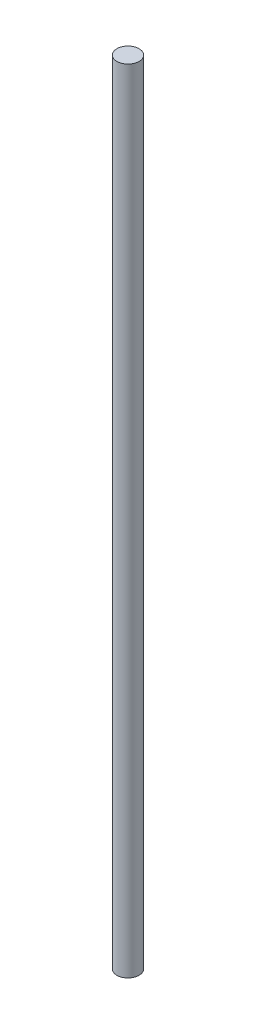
from build123d import *

# Parameters (mm, degrees)
CROQUIS1_R              = 7
SALIENTE_EXTRUIR1_DEPTH = 500


with BuildPart() as part:
    # Croquis1 → Saliente-Extruir1 (new body)
    with BuildSketch(Plane(origin=(0, 0, 0), x_dir=(1, 0, 0), z_dir=(0, 1, 0))):
        with Locations(Location((0, 0, 0), (0, 0, 270))):
            Circle(CROQUIS1_R)
    extrude(amount=SALIENTE_EXTRUIR1_DEPTH)


solid = part.part
